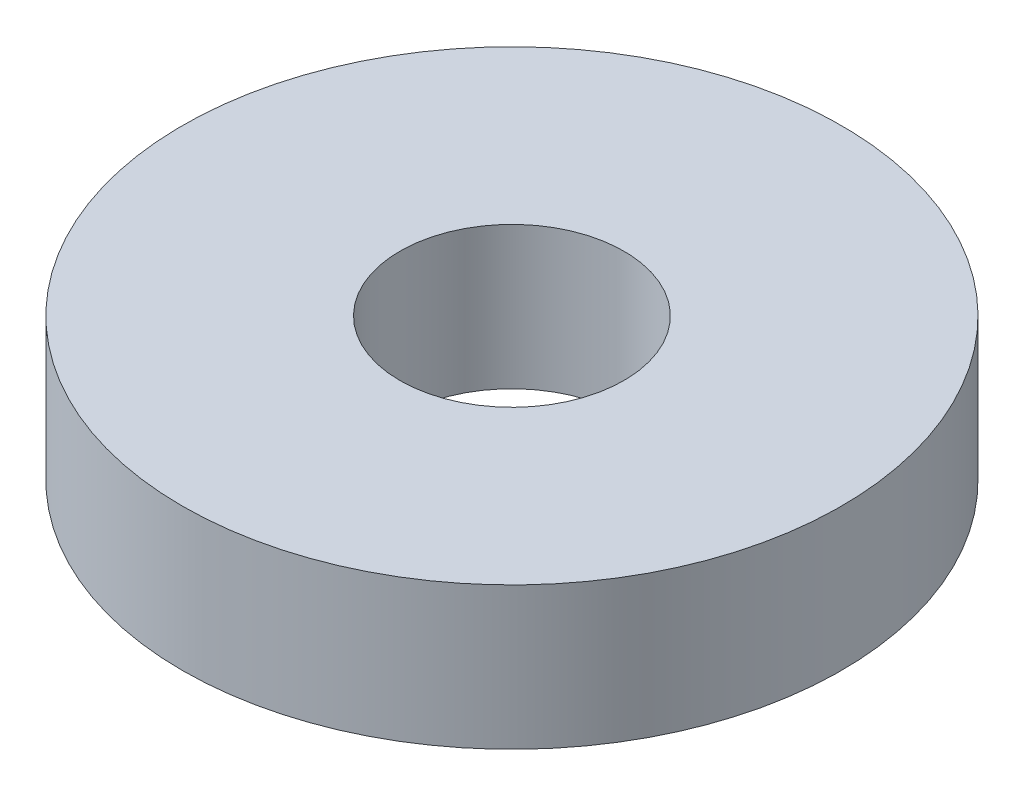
ISO-10303-21;
HEADER;
FILE_DESCRIPTION(('STEP AP214'),'2;1');
FILE_NAME('part.step','',(''),(''),'','','');
FILE_SCHEMA(('AUTOMOTIVE_DESIGN { 1 0 10303 214 1 1 1 1 }'));
ENDSEC;
DATA;
#1=APPLICATION_CONTEXT('core data for automotive mechanical design processes');
#2=APPLICATION_PROTOCOL_DEFINITION('international standard','automotive_design',2000,#1);
#3=PRODUCT_CONTEXT('',#1,'mechanical');
#4=PRODUCT('Part','Part','',(#3));
#5=PRODUCT_RELATED_PRODUCT_CATEGORY('part','',(#4));
#6=PRODUCT_DEFINITION_FORMATION('','',#4);
#7=PRODUCT_DEFINITION_CONTEXT('part definition',#1,'design');
#8=PRODUCT_DEFINITION('design','',#6,#7);
#9=PRODUCT_DEFINITION_SHAPE('','',#8);
#10=(LENGTH_UNIT() NAMED_UNIT(*) SI_UNIT(.MILLI.,.METRE.));
#11=(NAMED_UNIT(*) PLANE_ANGLE_UNIT() SI_UNIT($,.RADIAN.));
#12=(NAMED_UNIT(*) SI_UNIT($,.STERADIAN.) SOLID_ANGLE_UNIT());
#13=UNCERTAINTY_MEASURE_WITH_UNIT(LENGTH_MEASURE(1.E-05),#10,'distance_accuracy_value','');
#14=(GEOMETRIC_REPRESENTATION_CONTEXT(3) GLOBAL_UNCERTAINTY_ASSIGNED_CONTEXT((#13)) GLOBAL_UNIT_ASSIGNED_CONTEXT((#10,
#11,#12)) REPRESENTATION_CONTEXT('',''));
#15=CARTESIAN_POINT('',(0.,0.,0.));
#16=DIRECTION('',(0.,0.,1.));
#17=DIRECTION('',(1.,0.,0.));
#18=AXIS2_PLACEMENT_3D('',#15,#16,#17);
#19=CARTESIAN_POINT('',(0.,2.7432,0.));
#20=DIRECTION('',(0.,1.,0.));
#21=DIRECTION('',(0.,0.,1.));
#22=AXIS2_PLACEMENT_3D('',#19,#20,#21);
#23=PLANE('',#22);
#24=CARTESIAN_POINT('',(0.,2.7432,0.));
#25=DIRECTION('',(0.,1.,0.));
#26=DIRECTION('',(0.,0.,1.));
#27=AXIS2_PLACEMENT_3D('',#24,#25,#26);
#28=CIRCLE('',#27,6.35);
#29=CARTESIAN_POINT('',(0.,2.7432,6.35));
#30=VERTEX_POINT('',#29);
#31=EDGE_CURVE('E10',#30,#30,#28,.T.);
#32=ORIENTED_EDGE('',*,*,#31,.T.);
#33=EDGE_LOOP('',(#32));
#34=FACE_BOUND('',#33,.T.);
#35=CARTESIAN_POINT('',(0.,2.7432,0.));
#36=DIRECTION('',(0.,1.,0.));
#37=DIRECTION('',(0.,0.,1.));
#38=AXIS2_PLACEMENT_3D('',#35,#36,#37);
#39=CIRCLE('',#38,2.159);
#40=CARTESIAN_POINT('',(0.,2.7432,2.159));
#41=VERTEX_POINT('',#40);
#42=EDGE_CURVE('E50',#41,#41,#39,.T.);
#43=ORIENTED_EDGE('',*,*,#42,.F.);
#44=EDGE_LOOP('',(#43));
#45=FACE_BOUND('',#44,.T.);
#46=ADVANCED_FACE('F37',(#34,#45),#23,.T.);
#47=CARTESIAN_POINT('',(0.,0.,0.));
#48=DIRECTION('',(0.,1.,0.));
#49=DIRECTION('',(0.,0.,1.));
#50=AXIS2_PLACEMENT_3D('',#47,#48,#49);
#51=PLANE('',#50);
#52=CARTESIAN_POINT('',(0.,0.,0.));
#53=DIRECTION('',(0.,1.,0.));
#54=DIRECTION('',(0.,0.,1.));
#55=AXIS2_PLACEMENT_3D('',#52,#53,#54);
#56=CIRCLE('',#55,6.35);
#57=CARTESIAN_POINT('',(0.,0.,6.35));
#58=VERTEX_POINT('',#57);
#59=EDGE_CURVE('E41',#58,#58,#56,.T.);
#60=ORIENTED_EDGE('',*,*,#59,.F.);
#61=EDGE_LOOP('',(#60));
#62=FACE_BOUND('',#61,.T.);
#63=CARTESIAN_POINT('',(0.,0.,0.));
#64=DIRECTION('',(0.,1.,0.));
#65=DIRECTION('',(0.,0.,1.));
#66=AXIS2_PLACEMENT_3D('',#63,#64,#65);
#67=CIRCLE('',#66,2.159);
#68=CARTESIAN_POINT('',(0.,0.,2.159));
#69=VERTEX_POINT('',#68);
#70=EDGE_CURVE('E52',#69,#69,#67,.T.);
#71=ORIENTED_EDGE('',*,*,#70,.T.);
#72=EDGE_LOOP('',(#71));
#73=FACE_BOUND('',#72,.T.);
#74=ADVANCED_FACE('F64',(#62,#73),#51,.F.);
#75=CARTESIAN_POINT('',(0.,2.7432,0.));
#76=DIRECTION('',(0.,-1.,0.));
#77=DIRECTION('',(0.,0.,-1.));
#78=AXIS2_PLACEMENT_3D('',#75,#76,#77);
#79=CYLINDRICAL_SURFACE('',#78,6.35);
#80=ORIENTED_EDGE('',*,*,#31,.F.);
#81=EDGE_LOOP('',(#80));
#82=FACE_BOUND('',#81,.T.);
#83=ORIENTED_EDGE('',*,*,#59,.T.);
#84=EDGE_LOOP('',(#83));
#85=FACE_BOUND('',#84,.T.);
#86=ADVANCED_FACE('F39',(#82,#85),#79,.T.);
#87=CARTESIAN_POINT('',(0.,2.7432,0.));
#88=DIRECTION('',(0.,-1.,0.));
#89=DIRECTION('',(0.,0.,-1.));
#90=AXIS2_PLACEMENT_3D('',#87,#88,#89);
#91=CYLINDRICAL_SURFACE('',#90,2.159);
#92=ORIENTED_EDGE('',*,*,#42,.T.);
#93=EDGE_LOOP('',(#92));
#94=FACE_BOUND('',#93,.T.);
#95=ORIENTED_EDGE('',*,*,#70,.F.);
#96=EDGE_LOOP('',(#95));
#97=FACE_BOUND('',#96,.T.);
#98=ADVANCED_FACE('F60',(#94,#97),#91,.F.);
#99=CLOSED_SHELL('',(#46,#74,#86,#98));
#100=MANIFOLD_SOLID_BREP('B2',#99);
#101=ADVANCED_BREP_SHAPE_REPRESENTATION('',(#18,#100),#14);
#102=SHAPE_DEFINITION_REPRESENTATION(#9,#101);
ENDSEC;
END-ISO-10303-21;
